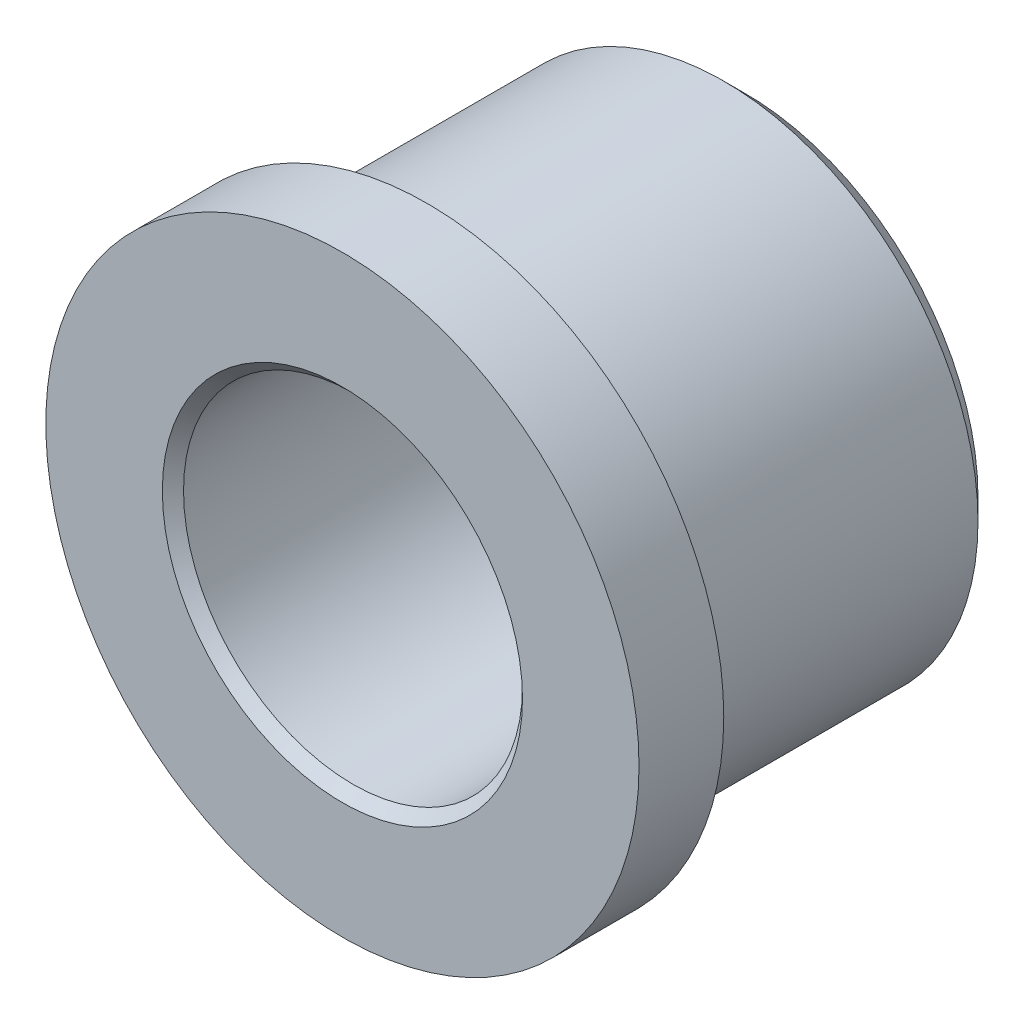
from build123d import *

# Parameters (mm, degrees)
ESQUISSE3_R          = 7
ESQUISSE3_R_2        = 6
BASE_EXTRUSION_DEPTH = 2
BOSS_EXTRU_1_START   = -9.5
ESQUISSE4_R          = 6
ESQUISSE4_R_2        = 4
BOSS_EXTRU_1_DEPTH   = 9.5
CHANFREIN1_SIZE      = 0.25
CHANFREIN2_SIZE      = 0.5


with BuildPart() as part:
    # Esquisse3 → Base-Extrusion (new body)
    with BuildSketch(Plane.XY):
        with Locations((0, 24.777112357)):
            Circle(ESQUISSE3_R)
        with Locations((0, 24.777112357)):
            Circle(ESQUISSE3_R_2, mode=Mode.SUBTRACT)
    extrude(amount=BASE_EXTRUSION_DEPTH)

    # Esquisse4 → Boss.-Extru.1 (add)
    with BuildSketch(Plane.XY.offset(2).offset(BOSS_EXTRU_1_START)):
        with Locations((0, 24.777112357)):
            Circle(ESQUISSE4_R)
        with Locations((0, 24.777112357)):
            Circle(ESQUISSE4_R_2, mode=Mode.SUBTRACT)
    extrude(amount=BOSS_EXTRU_1_DEPTH)

    # Chanfrein1
    chanfrein1_edges = [part.edges().sort_by_distance(p)[0] for p in [
        (-4, 24.777112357, 2),
    ]]
    chamfer(chanfrein1_edges, length=CHANFREIN1_SIZE)

    # Chanfrein2
    chanfrein2_edges = [part.edges().sort_by_distance(p)[0] for p in [
        (-4, 24.777112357, -7.5),
        (-6, 24.777112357, -7.5),
    ]]
    chamfer(chanfrein2_edges, length=CHANFREIN2_SIZE)


solid = part.part
